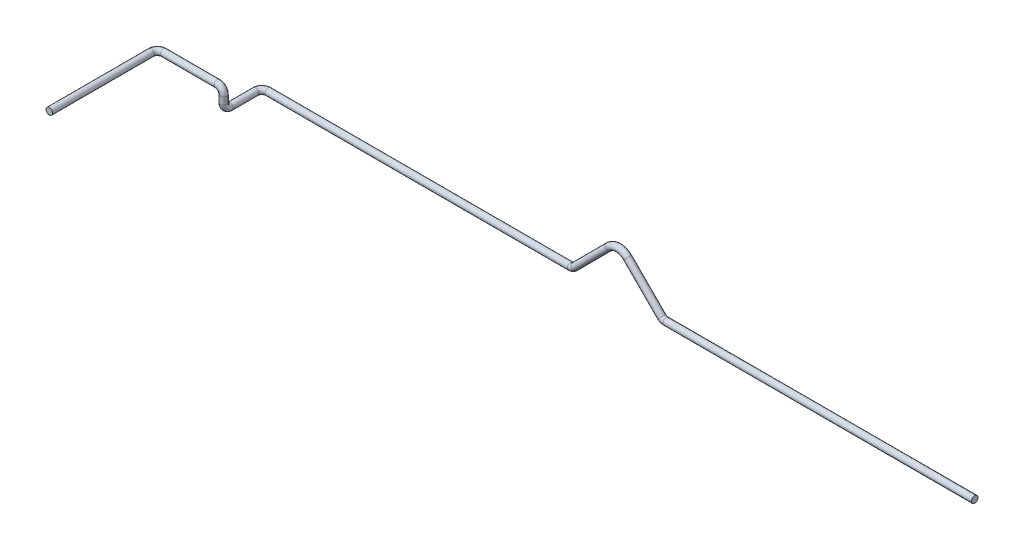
ISO-10303-21;
HEADER;
FILE_DESCRIPTION(('STEP AP214'),'2;1');
FILE_NAME('part.step','',(''),(''),'','','');
FILE_SCHEMA(('AUTOMOTIVE_DESIGN { 1 0 10303 214 1 1 1 1 }'));
ENDSEC;
DATA;
#1=APPLICATION_CONTEXT('core data for automotive mechanical design processes');
#2=APPLICATION_PROTOCOL_DEFINITION('international standard','automotive_design',2000,#1);
#3=PRODUCT_CONTEXT('',#1,'mechanical');
#4=PRODUCT('Part','Part','',(#3));
#5=PRODUCT_RELATED_PRODUCT_CATEGORY('part','',(#4));
#6=PRODUCT_DEFINITION_FORMATION('','',#4);
#7=PRODUCT_DEFINITION_CONTEXT('part definition',#1,'design');
#8=PRODUCT_DEFINITION('design','',#6,#7);
#9=PRODUCT_DEFINITION_SHAPE('','',#8);
#10=(LENGTH_UNIT() NAMED_UNIT(*) SI_UNIT(.MILLI.,.METRE.));
#11=(NAMED_UNIT(*) PLANE_ANGLE_UNIT() SI_UNIT($,.RADIAN.));
#12=(NAMED_UNIT(*) SI_UNIT($,.STERADIAN.) SOLID_ANGLE_UNIT());
#13=UNCERTAINTY_MEASURE_WITH_UNIT(LENGTH_MEASURE(1.E-05),#10,'distance_accuracy_value','');
#14=(GEOMETRIC_REPRESENTATION_CONTEXT(3) GLOBAL_UNCERTAINTY_ASSIGNED_CONTEXT((#13)) GLOBAL_UNIT_ASSIGNED_CONTEXT((#10,
#11,#12)) REPRESENTATION_CONTEXT('',''));
#15=CARTESIAN_POINT('',(0.,0.,0.));
#16=DIRECTION('',(0.,0.,1.));
#17=DIRECTION('',(1.,0.,0.));
#18=AXIS2_PLACEMENT_3D('',#15,#16,#17);
#19=CARTESIAN_POINT('',(11.4914398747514,0.,0.));
#20=DIRECTION('',(1.,0.,0.));
#21=DIRECTION('',(0.,1.,0.));
#22=AXIS2_PLACEMENT_3D('',#19,#20,#21);
#23=CYLINDRICAL_SURFACE('',#22,0.787400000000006);
#24=CARTESIAN_POINT('',(11.4914398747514,0.,0.));
#25=DIRECTION('',(-1.,0.,0.));
#26=DIRECTION('',(0.,-1.,0.));
#27=AXIS2_PLACEMENT_3D('',#24,#25,#26);
#28=CIRCLE('',#27,0.787400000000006);
#29=CARTESIAN_POINT('',(11.4914398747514,-0.787400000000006,0.));
#30=VERTEX_POINT('',#29);
#31=EDGE_CURVE('E37',#30,#30,#28,.T.);
#32=ORIENTED_EDGE('',*,*,#31,.F.);
#33=EDGE_LOOP('',(#32));
#34=FACE_BOUND('',#33,.T.);
#35=CARTESIAN_POINT('',(85.725,0.,0.));
#36=DIRECTION('',(-1.,0.,0.));
#37=DIRECTION('',(0.,-1.,0.));
#38=AXIS2_PLACEMENT_3D('',#35,#36,#37);
#39=CIRCLE('',#38,0.787400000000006);
#40=CARTESIAN_POINT('',(85.725,-0.787400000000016,0.));
#41=VERTEX_POINT('',#40);
#42=EDGE_CURVE('E10',#41,#41,#39,.T.);
#43=ORIENTED_EDGE('',*,*,#42,.T.);
#44=EDGE_LOOP('',(#43));
#45=FACE_BOUND('',#44,.T.);
#46=ADVANCED_FACE('F31',(#34,#45),#23,.T.);
#47=CARTESIAN_POINT('',(11.4914398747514,1.524,0.));
#48=DIRECTION('',(0.,0.,1.));
#49=DIRECTION('',(1.,0.,0.));
#50=AXIS2_PLACEMENT_3D('',#47,#48,#49);
#51=TOROIDAL_SURFACE('',#50,1.524,0.787400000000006);
#52=CARTESIAN_POINT('',(10.4117858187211,0.448396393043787,0.));
#53=DIRECTION('',(-0.705776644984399,0.708434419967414,0.));
#54=DIRECTION('',(-0.708434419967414,-0.705776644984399,0.));
#55=AXIS2_PLACEMENT_3D('',#52,#53,#54);
#56=CIRCLE('',#55,0.787400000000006);
#57=CARTESIAN_POINT('',(9.85396455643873,-0.107332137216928,0.));
#58=VERTEX_POINT('',#57);
#59=EDGE_CURVE('E41',#58,#58,#56,.T.);
#60=CARTESIAN_POINT('',(11.4914398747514,1.524,0.));
#61=DIRECTION('',(0.,0.,1.));
#62=DIRECTION('',(1.,0.,0.));
#63=AXIS2_PLACEMENT_3D('',#60,#61,#62);
#64=CIRCLE('',#63,2.31140000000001);
#65=EDGE_CURVE('',#58,#30,#64,.T.);
#66=ORIENTED_EDGE('',*,*,#59,.F.);
#67=ORIENTED_EDGE('',*,*,#31,.T.);
#68=ORIENTED_EDGE('',*,*,#65,.T.);
#69=ORIENTED_EDGE('',*,*,#65,.F.);
#70=EDGE_LOOP('',(#66,#68,#67,#69));
#71=FACE_BOUND('',#70,.T.);
#72=ADVANCED_FACE('F159',(#71),#51,.T.);
#73=CARTESIAN_POINT('',(2.24927928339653,8.64164084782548,0.));
#74=DIRECTION('',(0.7057766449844,-0.708434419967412,0.));
#75=DIRECTION('',(0.708434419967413,0.7057766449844,0.));
#76=AXIS2_PLACEMENT_3D('',#73,#74,#75);
#77=CYLINDRICAL_SURFACE('',#76,0.787400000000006);
#78=CARTESIAN_POINT('',(2.24927928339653,8.64164084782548,0.));
#79=DIRECTION('',(-0.705776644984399,0.708434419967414,0.));
#80=DIRECTION('',(-0.708434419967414,-0.705776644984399,0.));
#81=AXIS2_PLACEMENT_3D('',#78,#79,#80);
#82=CIRCLE('',#81,0.787400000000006);
#83=CARTESIAN_POINT('',(2.80710054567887,9.1973693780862,0.));
#84=VERTEX_POINT('',#83);
#85=EDGE_CURVE('E45',#84,#84,#82,.T.);
#86=ORIENTED_EDGE('',*,*,#85,.F.);
#87=EDGE_LOOP('',(#86));
#88=FACE_BOUND('',#87,.T.);
#89=ORIENTED_EDGE('',*,*,#59,.T.);
#90=EDGE_LOOP('',(#89));
#91=FACE_BOUND('',#90,.T.);
#92=ADVANCED_FACE('F153',(#88,#91),#77,.T.);
#93=CARTESIAN_POINT('',(0.,6.4008,0.));
#94=DIRECTION('',(0.,0.,-1.));
#95=DIRECTION('',(-1.,0.,0.));
#96=AXIS2_PLACEMENT_3D('',#93,#94,#95);
#97=TOROIDAL_SURFACE('',#96,3.175,0.787400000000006);
#98=CARTESIAN_POINT('',(-2.24927928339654,8.64164084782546,0.));
#99=DIRECTION('',(-0.705776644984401,-0.708434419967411,0.));
#100=DIRECTION('',(0.708434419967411,-0.705776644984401,0.));
#101=AXIS2_PLACEMENT_3D('',#98,#99,#100);
#102=CIRCLE('',#101,0.787400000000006);
#103=CARTESIAN_POINT('',(-2.80710054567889,9.19736937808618,0.));
#104=VERTEX_POINT('',#103);
#105=EDGE_CURVE('E50',#104,#104,#102,.T.);
#106=CARTESIAN_POINT('',(0.,6.4008,0.));
#107=DIRECTION('',(0.,0.,-1.));
#108=DIRECTION('',(-1.,0.,0.));
#109=AXIS2_PLACEMENT_3D('',#106,#107,#108);
#110=CIRCLE('',#109,3.9624);
#111=EDGE_CURVE('',#104,#84,#110,.T.);
#112=ORIENTED_EDGE('',*,*,#105,.F.);
#113=ORIENTED_EDGE('',*,*,#85,.T.);
#114=ORIENTED_EDGE('',*,*,#111,.T.);
#115=ORIENTED_EDGE('',*,*,#111,.F.);
#116=EDGE_LOOP('',(#112,#114,#113,#115));
#117=FACE_BOUND('',#116,.T.);
#118=ADVANCED_FACE('F147',(#117),#97,.T.);
#119=CARTESIAN_POINT('',(-10.4117858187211,0.448396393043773,0.));
#120=DIRECTION('',(0.7057766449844,0.708434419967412,0.));
#121=DIRECTION('',(-0.708434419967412,0.7057766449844,0.));
#122=AXIS2_PLACEMENT_3D('',#119,#120,#121);
#123=CYLINDRICAL_SURFACE('',#122,0.787400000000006);
#124=CARTESIAN_POINT('',(-10.4117858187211,0.448396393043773,0.));
#125=DIRECTION('',(-0.705776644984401,-0.708434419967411,0.));
#126=DIRECTION('',(0.708434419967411,-0.705776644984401,0.));
#127=AXIS2_PLACEMENT_3D('',#124,#125,#126);
#128=CIRCLE('',#127,0.787400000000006);
#129=CARTESIAN_POINT('',(-9.85396455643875,-0.107332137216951,0.));
#130=VERTEX_POINT('',#129);
#131=EDGE_CURVE('E53',#130,#130,#128,.T.);
#132=ORIENTED_EDGE('',*,*,#131,.F.);
#133=EDGE_LOOP('',(#132));
#134=FACE_BOUND('',#133,.T.);
#135=ORIENTED_EDGE('',*,*,#105,.T.);
#136=EDGE_LOOP('',(#135));
#137=FACE_BOUND('',#136,.T.);
#138=ADVANCED_FACE('F141',(#134,#137),#123,.T.);
#139=CARTESIAN_POINT('',(-11.4914398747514,1.524,0.));
#140=DIRECTION('',(0.,0.,1.));
#141=DIRECTION('',(1.,0.,0.));
#142=AXIS2_PLACEMENT_3D('',#139,#140,#141);
#143=TOROIDAL_SURFACE('',#142,1.524,0.787400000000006);
#144=CARTESIAN_POINT('',(-11.4914398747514,0.,0.));
#145=DIRECTION('',(-1.,0.,0.));
#146=DIRECTION('',(0.,-1.,0.));
#147=AXIS2_PLACEMENT_3D('',#144,#145,#146);
#148=CIRCLE('',#147,0.787400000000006);
#149=CARTESIAN_POINT('',(-11.4914398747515,-0.787400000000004,0.));
#150=VERTEX_POINT('',#149);
#151=EDGE_CURVE('E56',#150,#150,#148,.T.);
#152=CARTESIAN_POINT('',(-11.4914398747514,1.524,0.));
#153=DIRECTION('',(0.,0.,1.));
#154=DIRECTION('',(1.,0.,0.));
#155=AXIS2_PLACEMENT_3D('',#152,#153,#154);
#156=CIRCLE('',#155,2.31140000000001);
#157=EDGE_CURVE('',#150,#130,#156,.T.);
#158=ORIENTED_EDGE('',*,*,#151,.F.);
#159=ORIENTED_EDGE('',*,*,#131,.T.);
#160=ORIENTED_EDGE('',*,*,#157,.T.);
#161=ORIENTED_EDGE('',*,*,#157,.F.);
#162=EDGE_LOOP('',(#158,#160,#159,#161));
#163=FACE_BOUND('',#162,.T.);
#164=ADVANCED_FACE('F135',(#163),#143,.T.);
#165=CARTESIAN_POINT('',(-84.201,0.,0.));
#166=DIRECTION('',(1.,0.,0.));
#167=DIRECTION('',(0.,1.,0.));
#168=AXIS2_PLACEMENT_3D('',#165,#166,#167);
#169=CYLINDRICAL_SURFACE('',#168,0.787400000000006);
#170=CARTESIAN_POINT('',(-84.201,0.,0.));
#171=DIRECTION('',(-1.,0.,0.));
#172=DIRECTION('',(0.,-1.,0.));
#173=AXIS2_PLACEMENT_3D('',#170,#171,#172);
#174=CIRCLE('',#173,0.787400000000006);
#175=CARTESIAN_POINT('',(-84.201,0.,-0.787400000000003));
#176=VERTEX_POINT('',#175);
#177=EDGE_CURVE('E59',#176,#176,#174,.T.);
#178=ORIENTED_EDGE('',*,*,#177,.F.);
#179=EDGE_LOOP('',(#178));
#180=FACE_BOUND('',#179,.T.);
#181=ORIENTED_EDGE('',*,*,#151,.T.);
#182=EDGE_LOOP('',(#181));
#183=FACE_BOUND('',#182,.T.);
#184=ADVANCED_FACE('F129',(#180,#183),#169,.T.);
#185=CARTESIAN_POINT('',(-84.201,0.,1.524));
#186=DIRECTION('',(0.,-1.,0.));
#187=DIRECTION('',(0.,0.,-1.));
#188=AXIS2_PLACEMENT_3D('',#185,#186,#187);
#189=TOROIDAL_SURFACE('',#188,1.524,0.787400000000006);
#190=CARTESIAN_POINT('',(-85.725,0.,1.52400000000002));
#191=DIRECTION('',(0.,0.,1.));
#192=DIRECTION('',(0.,-1.,0.));
#193=AXIS2_PLACEMENT_3D('',#190,#191,#192);
#194=CIRCLE('',#193,0.787400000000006);
#195=CARTESIAN_POINT('',(-86.5124,0.,1.52400000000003));
#196=VERTEX_POINT('',#195);
#197=EDGE_CURVE('E62',#196,#196,#194,.T.);
#198=CARTESIAN_POINT('',(-84.201,0.,1.524));
#199=DIRECTION('',(0.,-1.,0.));
#200=DIRECTION('',(0.,0.,-1.));
#201=AXIS2_PLACEMENT_3D('',#198,#199,#200);
#202=CIRCLE('',#201,2.3114);
#203=EDGE_CURVE('',#196,#176,#202,.T.);
#204=ORIENTED_EDGE('',*,*,#197,.F.);
#205=ORIENTED_EDGE('',*,*,#177,.T.);
#206=ORIENTED_EDGE('',*,*,#203,.T.);
#207=ORIENTED_EDGE('',*,*,#203,.F.);
#208=EDGE_LOOP('',(#204,#206,#205,#207));
#209=FACE_BOUND('',#208,.T.);
#210=ADVANCED_FACE('F123',(#209),#189,.T.);
#211=CARTESIAN_POINT('',(-85.725,0.,7.67080000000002));
#212=DIRECTION('',(0.,0.,-1.));
#213=DIRECTION('',(0.,1.,0.));
#214=AXIS2_PLACEMENT_3D('',#211,#212,#213);
#215=CYLINDRICAL_SURFACE('',#214,0.787400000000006);
#216=CARTESIAN_POINT('',(-85.725,0.,7.67080000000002));
#217=DIRECTION('',(0.,0.,1.));
#218=DIRECTION('',(0.,-1.,0.));
#219=AXIS2_PLACEMENT_3D('',#216,#217,#218);
#220=CIRCLE('',#219,0.787400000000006);
#221=CARTESIAN_POINT('',(-85.725,-0.787400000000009,7.67080000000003));
#222=VERTEX_POINT('',#221);
#223=EDGE_CURVE('E65',#222,#222,#220,.T.);
#224=ORIENTED_EDGE('',*,*,#223,.F.);
#225=EDGE_LOOP('',(#224));
#226=FACE_BOUND('',#225,.T.);
#227=ORIENTED_EDGE('',*,*,#197,.T.);
#228=EDGE_LOOP('',(#227));
#229=FACE_BOUND('',#228,.T.);
#230=ADVANCED_FACE('F117',(#226,#229),#215,.T.);
#231=CARTESIAN_POINT('',(-85.725,1.524,7.6708));
#232=DIRECTION('',(1.,0.,0.));
#233=DIRECTION('',(0.,0.,-1.));
#234=AXIS2_PLACEMENT_3D('',#231,#232,#233);
#235=TOROIDAL_SURFACE('',#234,1.524,0.787400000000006);
#236=CARTESIAN_POINT('',(-85.725,1.52400000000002,9.1948));
#237=DIRECTION('',(0.,1.,0.));
#238=DIRECTION('',(0.,0.,1.));
#239=AXIS2_PLACEMENT_3D('',#236,#237,#238);
#240=CIRCLE('',#239,0.787400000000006);
#241=CARTESIAN_POINT('',(-85.725,1.52400000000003,9.98220000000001));
#242=VERTEX_POINT('',#241);
#243=EDGE_CURVE('E68',#242,#242,#240,.T.);
#244=CARTESIAN_POINT('',(-85.725,1.524,7.6708));
#245=DIRECTION('',(1.,0.,0.));
#246=DIRECTION('',(0.,0.,-1.));
#247=AXIS2_PLACEMENT_3D('',#244,#245,#246);
#248=CIRCLE('',#247,2.31140000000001);
#249=EDGE_CURVE('',#242,#222,#248,.T.);
#250=ORIENTED_EDGE('',*,*,#243,.F.);
#251=ORIENTED_EDGE('',*,*,#223,.T.);
#252=ORIENTED_EDGE('',*,*,#249,.T.);
#253=ORIENTED_EDGE('',*,*,#249,.F.);
#254=EDGE_LOOP('',(#250,#252,#251,#253));
#255=FACE_BOUND('',#254,.T.);
#256=ADVANCED_FACE('F111',(#255),#235,.T.);
#257=CARTESIAN_POINT('',(-85.725,3.23850000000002,9.1948));
#258=DIRECTION('',(0.,-1.,0.));
#259=DIRECTION('',(0.,0.,-1.));
#260=AXIS2_PLACEMENT_3D('',#257,#258,#259);
#261=CYLINDRICAL_SURFACE('',#260,0.787400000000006);
#262=CARTESIAN_POINT('',(-85.725,3.23850000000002,9.1948));
#263=DIRECTION('',(0.,1.,0.));
#264=DIRECTION('',(0.,0.,1.));
#265=AXIS2_PLACEMENT_3D('',#262,#263,#264);
#266=CIRCLE('',#265,0.787400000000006);
#267=CARTESIAN_POINT('',(-84.9376,3.23850000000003,9.1948));
#268=VERTEX_POINT('',#267);
#269=EDGE_CURVE('E71',#268,#268,#266,.T.);
#270=ORIENTED_EDGE('',*,*,#269,.F.);
#271=EDGE_LOOP('',(#270));
#272=FACE_BOUND('',#271,.T.);
#273=ORIENTED_EDGE('',*,*,#243,.T.);
#274=EDGE_LOOP('',(#273));
#275=FACE_BOUND('',#274,.T.);
#276=ADVANCED_FACE('F105',(#272,#275),#261,.T.);
#277=CARTESIAN_POINT('',(-87.249,3.2385,9.1948));
#278=DIRECTION('',(0.,0.,-1.));
#279=DIRECTION('',(-1.,0.,0.));
#280=AXIS2_PLACEMENT_3D('',#277,#278,#279);
#281=TOROIDAL_SURFACE('',#280,1.524,0.787400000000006);
#282=CARTESIAN_POINT('',(-87.249,4.7625,9.1948));
#283=DIRECTION('',(-1.,0.,0.));
#284=DIRECTION('',(0.,0.,1.));
#285=AXIS2_PLACEMENT_3D('',#282,#283,#284);
#286=CIRCLE('',#285,0.787400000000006);
#287=CARTESIAN_POINT('',(-87.249,5.54990000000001,9.1948));
#288=VERTEX_POINT('',#287);
#289=EDGE_CURVE('E74',#288,#288,#286,.T.);
#290=CARTESIAN_POINT('',(-87.249,3.2385,9.1948));
#291=DIRECTION('',(0.,0.,-1.));
#292=DIRECTION('',(-1.,0.,0.));
#293=AXIS2_PLACEMENT_3D('',#290,#291,#292);
#294=CIRCLE('',#293,2.31140000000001);
#295=EDGE_CURVE('',#288,#268,#294,.T.);
#296=ORIENTED_EDGE('',*,*,#289,.F.);
#297=ORIENTED_EDGE('',*,*,#269,.T.);
#298=ORIENTED_EDGE('',*,*,#295,.T.);
#299=ORIENTED_EDGE('',*,*,#295,.F.);
#300=EDGE_LOOP('',(#296,#298,#297,#299));
#301=FACE_BOUND('',#300,.T.);
#302=ADVANCED_FACE('F99',(#301),#281,.T.);
#303=CARTESIAN_POINT('',(-100.1268,4.7625,9.1948));
#304=DIRECTION('',(1.,0.,0.));
#305=DIRECTION('',(0.,0.,-1.));
#306=AXIS2_PLACEMENT_3D('',#303,#304,#305);
#307=CYLINDRICAL_SURFACE('',#306,0.787400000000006);
#308=CARTESIAN_POINT('',(-100.1268,4.7625,9.1948));
#309=DIRECTION('',(-1.,0.,0.));
#310=DIRECTION('',(0.,0.,1.));
#311=AXIS2_PLACEMENT_3D('',#308,#309,#310);
#312=CIRCLE('',#311,0.787400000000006);
#313=CARTESIAN_POINT('',(-100.1268,4.7625,8.4074));
#314=VERTEX_POINT('',#313);
#315=EDGE_CURVE('E77',#314,#314,#312,.T.);
#316=ORIENTED_EDGE('',*,*,#315,.F.);
#317=EDGE_LOOP('',(#316));
#318=FACE_BOUND('',#317,.T.);
#319=ORIENTED_EDGE('',*,*,#289,.T.);
#320=EDGE_LOOP('',(#319));
#321=FACE_BOUND('',#320,.T.);
#322=ADVANCED_FACE('F93',(#318,#321),#307,.T.);
#323=CARTESIAN_POINT('',(-100.1268,4.7625,10.7188));
#324=DIRECTION('',(0.,-1.,0.));
#325=DIRECTION('',(0.,0.,-1.));
#326=AXIS2_PLACEMENT_3D('',#323,#324,#325);
#327=TOROIDAL_SURFACE('',#326,1.524,0.787400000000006);
#328=CARTESIAN_POINT('',(-101.6508,4.7625,10.7188));
#329=DIRECTION('',(0.,0.,1.));
#330=DIRECTION('',(1.,0.,0.));
#331=AXIS2_PLACEMENT_3D('',#328,#329,#330);
#332=CIRCLE('',#331,0.787400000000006);
#333=CARTESIAN_POINT('',(-102.4382,4.7625,10.7188));
#334=VERTEX_POINT('',#333);
#335=EDGE_CURVE('E80',#334,#334,#332,.T.);
#336=CARTESIAN_POINT('',(-100.1268,4.7625,10.7188));
#337=DIRECTION('',(0.,-1.,0.));
#338=DIRECTION('',(0.,0.,-1.));
#339=AXIS2_PLACEMENT_3D('',#336,#337,#338);
#340=CIRCLE('',#339,2.3114);
#341=EDGE_CURVE('',#334,#314,#340,.T.);
#342=ORIENTED_EDGE('',*,*,#335,.F.);
#343=ORIENTED_EDGE('',*,*,#315,.T.);
#344=ORIENTED_EDGE('',*,*,#341,.T.);
#345=ORIENTED_EDGE('',*,*,#341,.F.);
#346=EDGE_LOOP('',(#342,#344,#343,#345));
#347=FACE_BOUND('',#346,.T.);
#348=ADVANCED_FACE('F90',(#347),#327,.T.);
#349=CARTESIAN_POINT('',(-101.6508,4.7625,10.7188));
#350=DIRECTION('',(0.,0.,1.));
#351=DIRECTION('',(1.,0.,0.));
#352=AXIS2_PLACEMENT_3D('',#349,#350,#351);
#353=CYLINDRICAL_SURFACE('',#352,0.787400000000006);
#354=ORIENTED_EDGE('',*,*,#335,.T.);
#355=EDGE_LOOP('',(#354));
#356=FACE_BOUND('',#355,.T.);
#357=CARTESIAN_POINT('',(-101.6508,4.7625,35.2044));
#358=DIRECTION('',(0.,0.,1.));
#359=DIRECTION('',(1.,0.,0.));
#360=AXIS2_PLACEMENT_3D('',#357,#358,#359);
#361=CIRCLE('',#360,0.787400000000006);
#362=CARTESIAN_POINT('',(-100.8634,4.7625,35.2044));
#363=VERTEX_POINT('',#362);
#364=EDGE_CURVE('E81',#363,#363,#361,.T.);
#365=ORIENTED_EDGE('',*,*,#364,.F.);
#366=EDGE_LOOP('',(#365));
#367=FACE_BOUND('',#366,.T.);
#368=ADVANCED_FACE('F87',(#356,#367),#353,.T.);
#369=CARTESIAN_POINT('',(85.725,0.,0.));
#370=DIRECTION('',(-1.,0.,0.));
#371=DIRECTION('',(0.,-1.,0.));
#372=AXIS2_PLACEMENT_3D('',#369,#370,#371);
#373=PLANE('',#372);
#374=ORIENTED_EDGE('',*,*,#42,.F.);
#375=EDGE_LOOP('',(#374));
#376=FACE_BOUND('',#375,.T.);
#377=ADVANCED_FACE('F171',(#376),#373,.F.);
#378=CARTESIAN_POINT('',(-101.6508,4.7625,35.2044));
#379=DIRECTION('',(0.,0.,1.));
#380=DIRECTION('',(1.,0.,0.));
#381=AXIS2_PLACEMENT_3D('',#378,#379,#380);
#382=PLANE('',#381);
#383=ORIENTED_EDGE('',*,*,#364,.T.);
#384=EDGE_LOOP('',(#383));
#385=FACE_BOUND('',#384,.T.);
#386=ADVANCED_FACE('F172',(#385),#382,.T.);
#387=CLOSED_SHELL('',(#46,#72,#92,#118,#138,#164,#184,#210,#230,#256,#276,#302,#322,#348,#368,
#377,#386));
#388=MANIFOLD_SOLID_BREP('B2',#387);
#389=ADVANCED_BREP_SHAPE_REPRESENTATION('',(#18,#388),#14);
#390=SHAPE_DEFINITION_REPRESENTATION(#9,#389);
ENDSEC;
END-ISO-10303-21;
